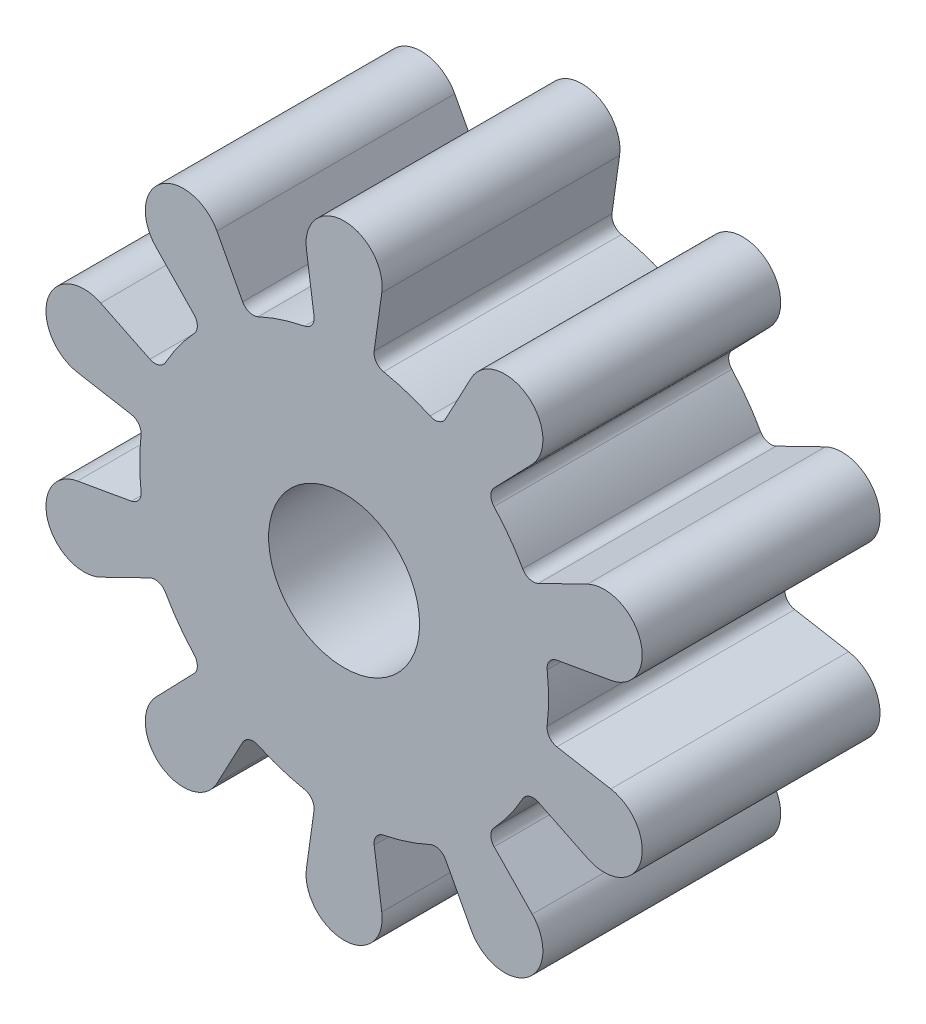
from build123d import *

# Parameters (mm, degrees)
SKETCH_1_R      = 3.175
EXTRUDE_1_DEPTH = 10


with BuildPart() as part:
    # Sketch 1 → Extrude 1 (new body)
    with BuildSketch(Plane.XY):
        with BuildLine():
            Line((-1.584438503, 11.277391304), (-1.26417438, 8.997881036))
            ThreePointArc((-1.26417438, 8.997881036), (-1.351887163, 8.638478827), (-1.662645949, 8.437749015))
            ThreePointArc((-1.662645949, 8.437749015), (-2.657546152, 8.17908604), (-3.614475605, 7.803561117))
            ThreePointArc((-3.614475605, 7.803561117), (-3.983870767, 7.783295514), (-4.266083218, 8.022501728))
            Line((-4.266083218, 8.022501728), (-5.346846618, 10.054910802))
            ThreePointArc((-5.346846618, 10.054910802), (-7.699986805, 10.598122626), (-7.910521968, 8.192291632))
            Line((-7.910521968, 8.192291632), (-6.311560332, 6.536375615))
            ThreePointArc((-6.311560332, 6.536375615), (-6.171270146, 6.194056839), (-6.304693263, 5.849003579))
            ThreePointArc((-6.304693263, 5.849003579), (-6.957546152, 5.05495317), (-7.51099033, 4.188678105))
            ThreePointArc((-7.51099033, 4.188678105), (-7.797925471, 3.955157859), (-8.166842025, 3.982799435))
            Line((-8.166842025, 3.982799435), (-10.235818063, 4.991796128))
            ThreePointArc((-10.235818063, 4.991796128), (-12.458840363, 4.048122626), (-11.215054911, 1.978015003))
            Line((-11.215054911, 1.978015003), (-8.948144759, 1.578196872))
            ThreePointArc((-8.948144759, 1.578196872), (-8.633437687, 1.383715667), (-8.538562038, 1.026137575))
            ThreePointArc((-8.538562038, 1.026137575), (-8.6, 0), (-8.538562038, -1.026137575))
            ThreePointArc((-8.538562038, -1.026137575), (-8.633437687, -1.383715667), (-8.948144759, -1.578196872))
            Line((-8.948144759, -1.578196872), (-11.215054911, -1.978015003))
            ThreePointArc((-11.215054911, -1.978015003), (-12.458840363, -4.048122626), (-10.235818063, -4.991796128))
            Line((-10.235818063, -4.991796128), (-8.166842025, -3.982799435))
            ThreePointArc((-8.166842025, -3.982799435), (-7.797925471, -3.955157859), (-7.51099033, -4.188678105))
            ThreePointArc((-7.51099033, -4.188678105), (-6.957546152, -5.05495317), (-6.304693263, -5.849003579))
            ThreePointArc((-6.304693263, -5.849003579), (-6.171270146, -6.194056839), (-6.311560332, -6.536375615))
            Line((-6.311560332, -6.536375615), (-7.910521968, -8.192291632))
            ThreePointArc((-7.910521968, -8.192291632), (-7.699986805, -10.598122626), (-5.346846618, -10.054910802))
            Line((-5.346846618, -10.054910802), (-4.266083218, -8.022501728))
            ThreePointArc((-4.266083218, -8.022501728), (-3.983870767, -7.783295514), (-3.614475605, -7.803561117))
            ThreePointArc((-3.614475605, -7.803561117), (-2.657546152, -8.17908604), (-1.662645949, -8.437749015))
            ThreePointArc((-1.662645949, -8.437749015), (-1.351887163, -8.638478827), (-1.26417438, -8.997881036))
            Line((-1.26417438, -8.997881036), (-1.584438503, -11.277391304))
            ThreePointArc((-1.584438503, -11.277391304), (0, -13.1), (1.584438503, -11.277391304))
            Line((1.584438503, -11.277391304), (1.26417438, -8.997881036))
            ThreePointArc((1.26417438, -8.997881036), (1.351887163, -8.638478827), (1.662645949, -8.437749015))
            ThreePointArc((1.662645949, -8.437749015), (2.657546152, -8.17908604), (3.614475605, -7.803561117))
            ThreePointArc((3.614475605, -7.803561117), (3.983870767, -7.783295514), (4.266083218, -8.022501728))
            Line((4.266083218, -8.022501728), (5.346846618, -10.054910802))
            ThreePointArc((5.346846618, -10.054910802), (7.699986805, -10.598122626), (7.910521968, -8.192291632))
            Line((7.910521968, -8.192291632), (6.311560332, -6.536375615))
            ThreePointArc((6.311560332, -6.536375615), (6.171270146, -6.194056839), (6.304693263, -5.849003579))
            ThreePointArc((6.304693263, -5.849003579), (6.957546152, -5.05495317), (7.51099033, -4.188678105))
            ThreePointArc((7.51099033, -4.188678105), (7.797925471, -3.955157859), (8.166842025, -3.982799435))
            Line((8.166842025, -3.982799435), (10.235818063, -4.991796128))
            ThreePointArc((10.235818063, -4.991796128), (12.458840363, -4.048122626), (11.215054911, -1.978015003))
            Line((11.215054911, -1.978015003), (8.948144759, -1.578196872))
            ThreePointArc((8.948144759, -1.578196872), (8.633437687, -1.383715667), (8.538562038, -1.026137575))
            ThreePointArc((8.538562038, -1.026137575), (8.6, 0), (8.538562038, 1.026137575))
            ThreePointArc((8.538562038, 1.026137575), (8.633437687, 1.383715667), (8.948144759, 1.578196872))
            Line((8.948144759, 1.578196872), (11.215054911, 1.978015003))
            ThreePointArc((11.215054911, 1.978015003), (12.458840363, 4.048122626), (10.235818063, 4.991796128))
            Line((10.235818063, 4.991796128), (8.166842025, 3.982799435))
            ThreePointArc((8.166842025, 3.982799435), (7.797925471, 3.955157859), (7.51099033, 4.188678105))
            ThreePointArc((7.51099033, 4.188678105), (6.957546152, 5.05495317), (6.304693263, 5.849003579))
            ThreePointArc((6.304693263, 5.849003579), (6.171270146, 6.194056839), (6.311560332, 6.536375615))
            Line((6.311560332, 6.536375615), (7.910521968, 8.192291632))
            ThreePointArc((7.910521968, 8.192291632), (7.699986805, 10.598122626), (5.346846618, 10.054910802))
            Line((5.346846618, 10.054910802), (4.266083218, 8.022501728))
            ThreePointArc((4.266083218, 8.022501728), (3.983870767, 7.783295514), (3.614475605, 7.803561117))
            ThreePointArc((3.614475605, 7.803561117), (2.657546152, 8.17908604), (1.662645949, 8.437749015))
            ThreePointArc((1.662645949, 8.437749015), (1.351887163, 8.638478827), (1.26417438, 8.997881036))
            Line((1.26417438, 8.997881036), (1.584438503, 11.277391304))
            ThreePointArc((1.584438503, 11.277391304), (0, 13.1), (-1.584438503, 11.277391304))
        make_face()
        Circle(SKETCH_1_R, mode=Mode.SUBTRACT)
    extrude(amount=EXTRUDE_1_DEPTH)


solid = part.part
